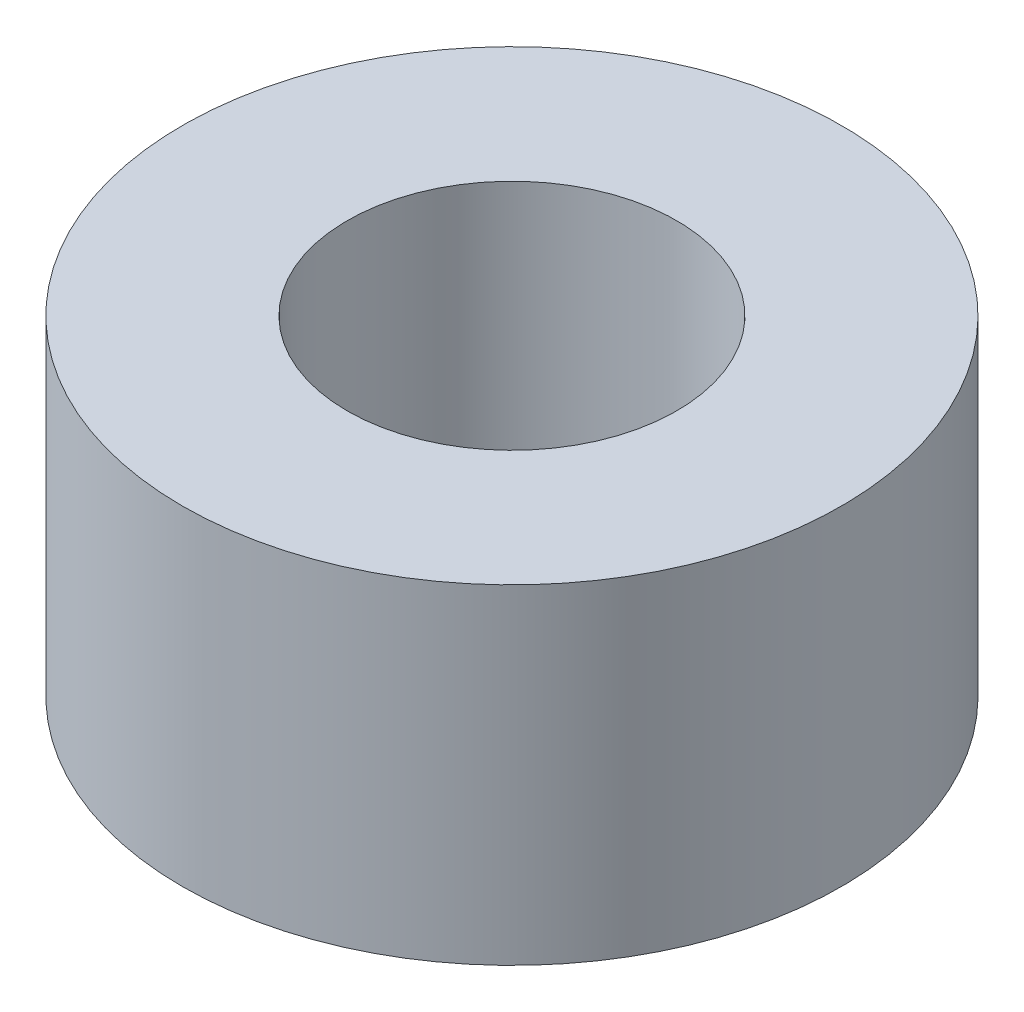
from build123d import *

# Parameters (mm, degrees)
SKETCH1_R           = 10
SKETCH1_R_2         = 5
BOSS_EXTRUDE1_DEPTH = 10


with BuildPart() as part:
    # Sketch1 → Boss-Extrude1 (new body)
    with BuildSketch(Plane(origin=(0, 0, 0), x_dir=(1, 0, 0), z_dir=(0, 1, 0))):
        with Locations(Location((0, 0, 0), (0, 0, 270))):
            Circle(SKETCH1_R)
        with Locations(Location((0, 0, 0), (0, 0, 270))):
            Circle(SKETCH1_R_2, mode=Mode.SUBTRACT)
    extrude(amount=BOSS_EXTRUDE1_DEPTH)


solid = part.part
